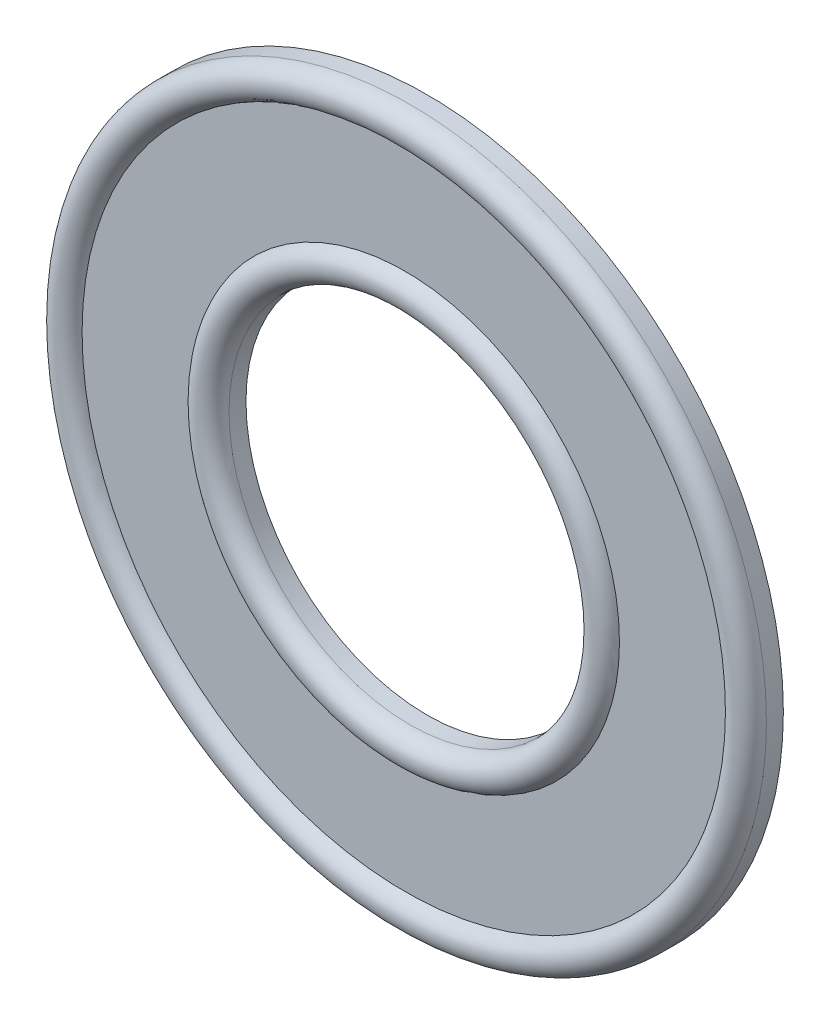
ISO-10303-21;
HEADER;
FILE_DESCRIPTION(('STEP AP214'),'2;1');
FILE_NAME('part.step','',(''),(''),'','','');
FILE_SCHEMA(('AUTOMOTIVE_DESIGN { 1 0 10303 214 1 1 1 1 }'));
ENDSEC;
DATA;
#1=APPLICATION_CONTEXT('core data for automotive mechanical design processes');
#2=APPLICATION_PROTOCOL_DEFINITION('international standard','automotive_design',2000,#1);
#3=PRODUCT_CONTEXT('',#1,'mechanical');
#4=PRODUCT('Part','Part','',(#3));
#5=PRODUCT_RELATED_PRODUCT_CATEGORY('part','',(#4));
#6=PRODUCT_DEFINITION_FORMATION('','',#4);
#7=PRODUCT_DEFINITION_CONTEXT('part definition',#1,'design');
#8=PRODUCT_DEFINITION('design','',#6,#7);
#9=PRODUCT_DEFINITION_SHAPE('','',#8);
#10=(LENGTH_UNIT() NAMED_UNIT(*) SI_UNIT(.MILLI.,.METRE.));
#11=(NAMED_UNIT(*) PLANE_ANGLE_UNIT() SI_UNIT($,.RADIAN.));
#12=(NAMED_UNIT(*) SI_UNIT($,.STERADIAN.) SOLID_ANGLE_UNIT());
#13=UNCERTAINTY_MEASURE_WITH_UNIT(LENGTH_MEASURE(1.E-05),#10,'distance_accuracy_value','');
#14=(GEOMETRIC_REPRESENTATION_CONTEXT(3) GLOBAL_UNCERTAINTY_ASSIGNED_CONTEXT((#13)) GLOBAL_UNIT_ASSIGNED_CONTEXT((#10,
#11,#12)) REPRESENTATION_CONTEXT('',''));
#15=CARTESIAN_POINT('',(0.,0.,0.));
#16=DIRECTION('',(0.,0.,1.));
#17=DIRECTION('',(1.,0.,0.));
#18=AXIS2_PLACEMENT_3D('',#15,#16,#17);
#19=CARTESIAN_POINT('',(0.,0.,2.61707874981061E-06));
#20=DIRECTION('',(0.,0.,1.));
#21=DIRECTION('',(1.,0.,0.));
#22=AXIS2_PLACEMENT_3D('',#19,#20,#21);
#23=TOROIDAL_SURFACE('',#22,29.9999999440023,1.500000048);
#24=CARTESIAN_POINT('',(0.,0.,0.));
#25=DIRECTION('',(0.,0.,1.));
#26=DIRECTION('',(1.,0.,0.));
#27=AXIS2_PLACEMENT_3D('',#24,#25,#26);
#28=CIRCLE('',#27,31.499999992);
#29=CARTESIAN_POINT('',(31.499999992,0.,0.));
#30=VERTEX_POINT('',#29);
#31=EDGE_CURVE('E12',#30,#30,#28,.T.);
#32=ORIENTED_EDGE('',*,*,#31,.T.);
#33=EDGE_LOOP('',(#32));
#34=FACE_BOUND('',#33,.T.);
#35=CARTESIAN_POINT('',(0.,0.,0.425003));
#36=DIRECTION('',(0.,0.,1.));
#37=DIRECTION('',(1.,0.,0.));
#38=AXIS2_PLACEMENT_3D('',#35,#36,#37);
#39=CIRCLE('',#38,28.561467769);
#40=CARTESIAN_POINT('',(28.561467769,0.,0.425003));
#41=VERTEX_POINT('',#40);
#42=EDGE_CURVE('E64',#41,#41,#39,.T.);
#43=ORIENTED_EDGE('',*,*,#42,.F.);
#44=EDGE_LOOP('',(#43));
#45=FACE_BOUND('',#44,.T.);
#46=ADVANCED_FACE('F42',(#34,#45),#23,.T.);
#47=CARTESIAN_POINT('',(0.,0.,44.0558558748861));
#48=DIRECTION('',(0.,0.,1.));
#49=DIRECTION('',(1.,0.,0.));
#50=AXIS2_PLACEMENT_3D('',#47,#48,#49);
#51=CYLINDRICAL_SURFACE('',#50,31.499999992);
#52=CARTESIAN_POINT('',(0.,0.,-1.499997));
#53=DIRECTION('',(0.,0.,1.));
#54=DIRECTION('',(1.,0.,0.));
#55=AXIS2_PLACEMENT_3D('',#52,#53,#54);
#56=CIRCLE('',#55,31.499999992);
#57=CARTESIAN_POINT('',(31.499999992,0.,-1.499997));
#58=VERTEX_POINT('',#57);
#59=EDGE_CURVE('E48',#58,#58,#56,.T.);
#60=ORIENTED_EDGE('',*,*,#59,.T.);
#61=EDGE_LOOP('',(#60));
#62=FACE_BOUND('',#61,.T.);
#63=ORIENTED_EDGE('',*,*,#31,.F.);
#64=EDGE_LOOP('',(#63));
#65=FACE_BOUND('',#64,.T.);
#66=ADVANCED_FACE('F72',(#62,#65),#51,.T.);
#67=CARTESIAN_POINT('',(16.000000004,0.,-1.499997));
#68=DIRECTION('',(0.,0.,-1.));
#69=DIRECTION('',(-1.,0.,0.));
#70=AXIS2_PLACEMENT_3D('',#67,#68,#69);
#71=PLANE('',#70);
#72=CARTESIAN_POINT('',(0.,0.,-1.499997));
#73=DIRECTION('',(0.,0.,1.));
#74=DIRECTION('',(1.,0.,0.));
#75=AXIS2_PLACEMENT_3D('',#72,#73,#74);
#76=CIRCLE('',#75,16.000000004);
#77=CARTESIAN_POINT('',(16.000000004,0.,-1.499997));
#78=VERTEX_POINT('',#77);
#79=EDGE_CURVE('E52',#78,#78,#76,.T.);
#80=ORIENTED_EDGE('',*,*,#79,.T.);
#81=EDGE_LOOP('',(#80));
#82=FACE_BOUND('',#81,.T.);
#83=ORIENTED_EDGE('',*,*,#59,.F.);
#84=EDGE_LOOP('',(#83));
#85=FACE_BOUND('',#84,.T.);
#86=ADVANCED_FACE('F76',(#82,#85),#71,.T.);
#87=CARTESIAN_POINT('',(0.,0.,44.0558558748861));
#88=DIRECTION('',(0.,0.,1.));
#89=DIRECTION('',(1.,0.,0.));
#90=AXIS2_PLACEMENT_3D('',#87,#88,#89);
#91=CYLINDRICAL_SURFACE('',#90,16.000000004);
#92=CARTESIAN_POINT('',(0.,0.,0.));
#93=DIRECTION('',(0.,0.,1.));
#94=DIRECTION('',(1.,0.,0.));
#95=AXIS2_PLACEMENT_3D('',#92,#93,#94);
#96=CIRCLE('',#95,16.000000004);
#97=CARTESIAN_POINT('',(16.000000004,0.,0.));
#98=VERTEX_POINT('',#97);
#99=EDGE_CURVE('E56',#98,#98,#96,.T.);
#100=ORIENTED_EDGE('',*,*,#99,.T.);
#101=EDGE_LOOP('',(#100));
#102=FACE_BOUND('',#101,.T.);
#103=ORIENTED_EDGE('',*,*,#79,.F.);
#104=EDGE_LOOP('',(#103));
#105=FACE_BOUND('',#104,.T.);
#106=ADVANCED_FACE('F80',(#102,#105),#91,.F.);
#107=CARTESIAN_POINT('',(0.,0.,2.61707874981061E-06));
#108=DIRECTION('',(0.,0.,1.));
#109=DIRECTION('',(1.,0.,0.));
#110=AXIS2_PLACEMENT_3D('',#107,#108,#109);
#111=TOROIDAL_SURFACE('',#110,17.5000000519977,1.500000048);
#112=CARTESIAN_POINT('',(0.,0.,0.425003));
#113=DIRECTION('',(0.,0.,1.));
#114=DIRECTION('',(1.,0.,0.));
#115=AXIS2_PLACEMENT_3D('',#112,#113,#114);
#116=CIRCLE('',#115,18.938532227);
#117=CARTESIAN_POINT('',(18.938532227,0.,0.425003));
#118=VERTEX_POINT('',#117);
#119=EDGE_CURVE('E61',#118,#118,#116,.T.);
#120=ORIENTED_EDGE('',*,*,#119,.T.);
#121=EDGE_LOOP('',(#120));
#122=FACE_BOUND('',#121,.T.);
#123=ORIENTED_EDGE('',*,*,#99,.F.);
#124=EDGE_LOOP('',(#123));
#125=FACE_BOUND('',#124,.T.);
#126=ADVANCED_FACE('F87',(#122,#125),#111,.T.);
#127=CARTESIAN_POINT('',(28.561467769,0.,0.425003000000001));
#128=DIRECTION('',(0.,0.,1.));
#129=DIRECTION('',(1.,0.,0.));
#130=AXIS2_PLACEMENT_3D('',#127,#128,#129);
#131=PLANE('',#130);
#132=ORIENTED_EDGE('',*,*,#42,.T.);
#133=EDGE_LOOP('',(#132));
#134=FACE_BOUND('',#133,.T.);
#135=ORIENTED_EDGE('',*,*,#119,.F.);
#136=EDGE_LOOP('',(#135));
#137=FACE_BOUND('',#136,.T.);
#138=ADVANCED_FACE('F68',(#134,#137),#131,.T.);
#139=CLOSED_SHELL('',(#46,#66,#86,#106,#126,#138));
#140=MANIFOLD_SOLID_BREP('B2',#139);
#141=ADVANCED_BREP_SHAPE_REPRESENTATION('',(#18,#140),#14);
#142=SHAPE_DEFINITION_REPRESENTATION(#9,#141);
ENDSEC;
END-ISO-10303-21;
